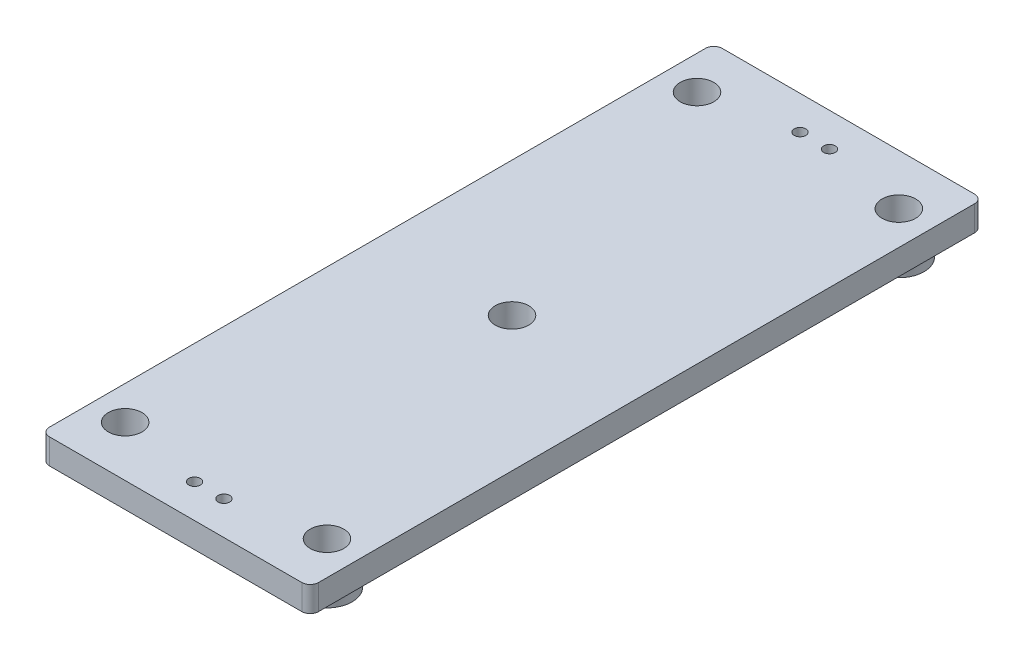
ISO-10303-21;
HEADER;
FILE_DESCRIPTION(('STEP AP214'),'2;1');
FILE_NAME('part.step','',(''),(''),'','','');
FILE_SCHEMA(('AUTOMOTIVE_DESIGN { 1 0 10303 214 1 1 1 1 }'));
ENDSEC;
DATA;
#1=APPLICATION_CONTEXT('core data for automotive mechanical design processes');
#2=APPLICATION_PROTOCOL_DEFINITION('international standard','automotive_design',2000,#1);
#3=PRODUCT_CONTEXT('',#1,'mechanical');
#4=PRODUCT('Part','Part','',(#3));
#5=PRODUCT_RELATED_PRODUCT_CATEGORY('part','',(#4));
#6=PRODUCT_DEFINITION_FORMATION('','',#4);
#7=PRODUCT_DEFINITION_CONTEXT('part definition',#1,'design');
#8=PRODUCT_DEFINITION('design','',#6,#7);
#9=PRODUCT_DEFINITION_SHAPE('','',#8);
#10=(LENGTH_UNIT() NAMED_UNIT(*) SI_UNIT(.MILLI.,.METRE.));
#11=(NAMED_UNIT(*) PLANE_ANGLE_UNIT() SI_UNIT($,.RADIAN.));
#12=(NAMED_UNIT(*) SI_UNIT($,.STERADIAN.) SOLID_ANGLE_UNIT());
#13=UNCERTAINTY_MEASURE_WITH_UNIT(LENGTH_MEASURE(1.E-05),#10,'distance_accuracy_value','');
#14=(GEOMETRIC_REPRESENTATION_CONTEXT(3) GLOBAL_UNCERTAINTY_ASSIGNED_CONTEXT((#13)) GLOBAL_UNIT_ASSIGNED_CONTEXT((#10,
#11,#12)) REPRESENTATION_CONTEXT('',''));
#15=CARTESIAN_POINT('',(0.,0.,0.));
#16=DIRECTION('',(0.,0.,1.));
#17=DIRECTION('',(1.,0.,0.));
#18=AXIS2_PLACEMENT_3D('',#15,#16,#17);
#19=CARTESIAN_POINT('',(101.6,0.,0.));
#20=DIRECTION('',(0.,-1.,0.));
#21=DIRECTION('',(0.,0.,-1.));
#22=AXIS2_PLACEMENT_3D('',#19,#20,#21);
#23=PLANE('',#22);
#24=CARTESIAN_POINT('',(76.1999999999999,0.,469.9));
#25=DIRECTION('',(0.,-1.,0.));
#26=DIRECTION('',(0.,0.,-1.));
#27=AXIS2_PLACEMENT_3D('',#24,#25,#26);
#28=CIRCLE('',#27,22.225);
#29=CARTESIAN_POINT('',(76.1999999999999,0.,447.675));
#30=VERTEX_POINT('',#29);
#31=EDGE_CURVE('E173',#30,#30,#28,.F.);
#32=ORIENTED_EDGE('',*,*,#31,.T.);
#33=EDGE_LOOP('',(#32));
#34=FACE_BOUND('',#33,.T.);
#35=CARTESIAN_POINT('',(-76.2000000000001,0.,469.9));
#36=DIRECTION('',(0.,-1.,0.));
#37=DIRECTION('',(0.,0.,-1.));
#38=AXIS2_PLACEMENT_3D('',#35,#36,#37);
#39=CIRCLE('',#38,22.225);
#40=CARTESIAN_POINT('',(-76.2000000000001,0.,447.675));
#41=VERTEX_POINT('',#40);
#42=EDGE_CURVE('E170',#41,#41,#39,.F.);
#43=ORIENTED_EDGE('',*,*,#42,.T.);
#44=EDGE_LOOP('',(#43));
#45=FACE_BOUND('',#44,.T.);
#46=CARTESIAN_POINT('',(-76.2000000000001,0.,38.1));
#47=DIRECTION('',(0.,-1.,0.));
#48=DIRECTION('',(0.,0.,-1.));
#49=AXIS2_PLACEMENT_3D('',#46,#47,#48);
#50=CIRCLE('',#49,22.225);
#51=CARTESIAN_POINT('',(-76.2000000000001,0.,15.875));
#52=VERTEX_POINT('',#51);
#53=EDGE_CURVE('E167',#52,#52,#50,.F.);
#54=ORIENTED_EDGE('',*,*,#53,.T.);
#55=EDGE_LOOP('',(#54));
#56=FACE_BOUND('',#55,.T.);
#57=CARTESIAN_POINT('',(76.1999999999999,0.,38.1));
#58=DIRECTION('',(0.,-1.,0.));
#59=DIRECTION('',(0.,0.,-1.));
#60=AXIS2_PLACEMENT_3D('',#57,#58,#59);
#61=CIRCLE('',#60,22.225);
#62=CARTESIAN_POINT('',(76.1999999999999,0.,15.875));
#63=VERTEX_POINT('',#62);
#64=EDGE_CURVE('E164',#63,#63,#61,.F.);
#65=ORIENTED_EDGE('',*,*,#64,.T.);
#66=EDGE_LOOP('',(#65));
#67=FACE_BOUND('',#66,.T.);
#68=CARTESIAN_POINT('',(-11.1125000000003,0.,25.3999999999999));
#69=DIRECTION('',(0.,1.,0.));
#70=DIRECTION('',(0.,0.,1.));
#71=AXIS2_PLACEMENT_3D('',#68,#69,#70);
#72=CIRCLE('',#71,4.365625);
#73=CARTESIAN_POINT('',(-11.1125000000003,0.,21.0343749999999));
#74=VERTEX_POINT('',#73);
#75=EDGE_CURVE('E278',#74,#74,#72,.T.);
#76=ORIENTED_EDGE('',*,*,#75,.T.);
#77=EDGE_LOOP('',(#76));
#78=FACE_BOUND('',#77,.T.);
#79=CARTESIAN_POINT('',(-11.1125000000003,0.,482.6));
#80=DIRECTION('',(0.,-1.,0.));
#81=DIRECTION('',(0.,0.,-1.));
#82=AXIS2_PLACEMENT_3D('',#79,#80,#81);
#83=CIRCLE('',#82,4.365625);
#84=CARTESIAN_POINT('',(-11.1125000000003,0.,478.234375));
#85=VERTEX_POINT('',#84);
#86=EDGE_CURVE('E288',#85,#85,#83,.T.);
#87=ORIENTED_EDGE('',*,*,#86,.F.);
#88=EDGE_LOOP('',(#87));
#89=FACE_BOUND('',#88,.T.);
#90=CARTESIAN_POINT('',(11.1124999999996,0.,482.6));
#91=DIRECTION('',(0.,-1.,0.));
#92=DIRECTION('',(0.,0.,-1.));
#93=AXIS2_PLACEMENT_3D('',#90,#91,#92);
#94=CIRCLE('',#93,4.365625);
#95=CARTESIAN_POINT('',(11.1124999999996,0.,478.234375));
#96=VERTEX_POINT('',#95);
#97=EDGE_CURVE('E293',#96,#96,#94,.T.);
#98=ORIENTED_EDGE('',*,*,#97,.F.);
#99=EDGE_LOOP('',(#98));
#100=FACE_BOUND('',#99,.T.);
#101=CARTESIAN_POINT('',(0.,0.,254.));
#102=DIRECTION('',(0.,-1.,0.));
#103=DIRECTION('',(0.,0.,-1.));
#104=AXIS2_PLACEMENT_3D('',#101,#102,#103);
#105=CIRCLE('',#104,12.7);
#106=CARTESIAN_POINT('',(0.,0.,241.3));
#107=VERTEX_POINT('',#106);
#108=EDGE_CURVE('E304',#107,#107,#105,.T.);
#109=ORIENTED_EDGE('',*,*,#108,.F.);
#110=EDGE_LOOP('',(#109));
#111=FACE_BOUND('',#110,.T.);
#112=DIRECTION('',(1.,0.,0.));
#113=VECTOR('',#112,1.);
#114=CARTESIAN_POINT('',(-101.6,0.,508.));
#115=LINE('',#114,#113);
#116=CARTESIAN_POINT('',(-95.25,0.,508.));
#117=VERTEX_POINT('',#116);
#118=CARTESIAN_POINT('',(95.2499999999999,0.,508.));
#119=VERTEX_POINT('',#118);
#120=EDGE_CURVE('E116',#117,#119,#115,.T.);
#121=ORIENTED_EDGE('',*,*,#120,.F.);
#122=CARTESIAN_POINT('',(-95.25,0.,501.65));
#123=DIRECTION('',(0.,-1.,0.));
#124=DIRECTION('',(0.,0.,-1.));
#125=AXIS2_PLACEMENT_3D('',#122,#123,#124);
#126=CIRCLE('',#125,6.35);
#127=CARTESIAN_POINT('',(-101.6,0.,501.65));
#128=VERTEX_POINT('',#127);
#129=EDGE_CURVE('E99',#117,#128,#126,.T.);
#130=ORIENTED_EDGE('',*,*,#129,.T.);
#131=DIRECTION('',(0.,0.,-1.));
#132=VECTOR('',#131,1.);
#133=CARTESIAN_POINT('',(-101.6,0.,508.));
#134=LINE('',#133,#132);
#135=CARTESIAN_POINT('',(-101.6,0.,6.35000000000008));
#136=VERTEX_POINT('',#135);
#137=EDGE_CURVE('E125',#128,#136,#134,.T.);
#138=ORIENTED_EDGE('',*,*,#137,.T.);
#139=CARTESIAN_POINT('',(-95.25,0.,6.35000000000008));
#140=DIRECTION('',(0.,-1.,0.));
#141=DIRECTION('',(0.,0.,-1.));
#142=AXIS2_PLACEMENT_3D('',#139,#140,#141);
#143=CIRCLE('',#142,6.35);
#144=CARTESIAN_POINT('',(-95.25,0.,0.));
#145=VERTEX_POINT('',#144);
#146=EDGE_CURVE('E110',#136,#145,#143,.T.);
#147=ORIENTED_EDGE('',*,*,#146,.T.);
#148=DIRECTION('',(-1.,0.,0.));
#149=VECTOR('',#148,1.);
#150=CARTESIAN_POINT('',(101.6,0.,0.));
#151=LINE('',#150,#149);
#152=CARTESIAN_POINT('',(95.25,0.,0.));
#153=VERTEX_POINT('',#152);
#154=EDGE_CURVE('E128',#153,#145,#151,.T.);
#155=ORIENTED_EDGE('',*,*,#154,.F.);
#156=CARTESIAN_POINT('',(95.25,0.,6.35000000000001));
#157=DIRECTION('',(0.,-1.,0.));
#158=DIRECTION('',(0.,0.,-1.));
#159=AXIS2_PLACEMENT_3D('',#156,#157,#158);
#160=CIRCLE('',#159,6.35);
#161=CARTESIAN_POINT('',(101.6,0.,6.35000000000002));
#162=VERTEX_POINT('',#161);
#163=EDGE_CURVE('E139',#153,#162,#160,.T.);
#164=ORIENTED_EDGE('',*,*,#163,.T.);
#165=DIRECTION('',(0.,0.,1.));
#166=VECTOR('',#165,1.);
#167=CARTESIAN_POINT('',(101.6,0.,0.));
#168=LINE('',#167,#166);
#169=CARTESIAN_POINT('',(101.6,0.,501.65));
#170=VERTEX_POINT('',#169);
#171=EDGE_CURVE('E126',#162,#170,#168,.T.);
#172=ORIENTED_EDGE('',*,*,#171,.T.);
#173=CARTESIAN_POINT('',(95.2499999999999,0.,501.65));
#174=DIRECTION('',(0.,-1.,0.));
#175=DIRECTION('',(0.,0.,-1.));
#176=AXIS2_PLACEMENT_3D('',#173,#174,#175);
#177=CIRCLE('',#176,6.35);
#178=EDGE_CURVE('E120',#170,#119,#177,.T.);
#179=ORIENTED_EDGE('',*,*,#178,.T.);
#180=EDGE_LOOP('',(#121,#130,#138,#147,#155,#164,#172,#179));
#181=FACE_BOUND('',#180,.T.);
#182=CARTESIAN_POINT('',(11.1124999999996,0.,25.3999999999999));
#183=DIRECTION('',(0.,1.,0.));
#184=DIRECTION('',(0.,0.,1.));
#185=AXIS2_PLACEMENT_3D('',#182,#183,#184);
#186=CIRCLE('',#185,4.365625);
#187=CARTESIAN_POINT('',(11.1124999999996,0.,21.0343749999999));
#188=VERTEX_POINT('',#187);
#189=EDGE_CURVE('E279',#188,#188,#186,.T.);
#190=ORIENTED_EDGE('',*,*,#189,.T.);
#191=EDGE_LOOP('',(#190));
#192=FACE_BOUND('',#191,.T.);
#193=ADVANCED_FACE('F32',(#34,#45,#56,#67,#78,#89,#100,#111,#181,#192),#23,.T.);
#194=CARTESIAN_POINT('',(101.6,19.05,0.));
#195=DIRECTION('',(0.,-1.,0.));
#196=DIRECTION('',(0.,0.,-1.));
#197=AXIS2_PLACEMENT_3D('',#194,#195,#196);
#198=PLANE('',#197);
#199=CARTESIAN_POINT('',(-11.1125000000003,19.05,25.3999999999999));
#200=DIRECTION('',(0.,1.,0.));
#201=DIRECTION('',(0.,0.,1.));
#202=AXIS2_PLACEMENT_3D('',#199,#200,#201);
#203=CIRCLE('',#202,4.365625);
#204=CARTESIAN_POINT('',(-11.1125000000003,19.05,21.0343749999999));
#205=VERTEX_POINT('',#204);
#206=EDGE_CURVE('E282',#205,#205,#203,.T.);
#207=ORIENTED_EDGE('',*,*,#206,.F.);
#208=EDGE_LOOP('',(#207));
#209=FACE_BOUND('',#208,.T.);
#210=CARTESIAN_POINT('',(-11.1125000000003,19.05,482.6));
#211=DIRECTION('',(0.,-1.,0.));
#212=DIRECTION('',(0.,0.,-1.));
#213=AXIS2_PLACEMENT_3D('',#210,#211,#212);
#214=CIRCLE('',#213,4.365625);
#215=CARTESIAN_POINT('',(-11.1125000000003,19.05,478.234375));
#216=VERTEX_POINT('',#215);
#217=EDGE_CURVE('E290',#216,#216,#214,.T.);
#218=ORIENTED_EDGE('',*,*,#217,.T.);
#219=EDGE_LOOP('',(#218));
#220=FACE_BOUND('',#219,.T.);
#221=CARTESIAN_POINT('',(11.1124999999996,19.05,482.6));
#222=DIRECTION('',(0.,-1.,0.));
#223=DIRECTION('',(0.,0.,-1.));
#224=AXIS2_PLACEMENT_3D('',#221,#222,#223);
#225=CIRCLE('',#224,4.365625);
#226=CARTESIAN_POINT('',(11.1124999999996,19.05,478.234375));
#227=VERTEX_POINT('',#226);
#228=EDGE_CURVE('E296',#227,#227,#225,.T.);
#229=ORIENTED_EDGE('',*,*,#228,.T.);
#230=EDGE_LOOP('',(#229));
#231=FACE_BOUND('',#230,.T.);
#232=CARTESIAN_POINT('',(0.,19.05,254.));
#233=DIRECTION('',(0.,1.,0.));
#234=DIRECTION('',(0.,0.,1.));
#235=AXIS2_PLACEMENT_3D('',#232,#233,#234);
#236=CIRCLE('',#235,12.7);
#237=CARTESIAN_POINT('',(0.,19.05,266.7));
#238=VERTEX_POINT('',#237);
#239=EDGE_CURVE('E299',#238,#238,#236,.T.);
#240=ORIENTED_EDGE('',*,*,#239,.F.);
#241=EDGE_LOOP('',(#240));
#242=FACE_BOUND('',#241,.T.);
#243=CARTESIAN_POINT('',(-76.2000000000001,19.05,38.1));
#244=DIRECTION('',(0.,-1.,0.));
#245=DIRECTION('',(0.,0.,-1.));
#246=AXIS2_PLACEMENT_3D('',#243,#244,#245);
#247=CIRCLE('',#246,12.7);
#248=CARTESIAN_POINT('',(-76.2000000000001,19.05,25.4));
#249=VERTEX_POINT('',#248);
#250=EDGE_CURVE('E308',#249,#249,#247,.T.);
#251=ORIENTED_EDGE('',*,*,#250,.T.);
#252=EDGE_LOOP('',(#251));
#253=FACE_BOUND('',#252,.T.);
#254=CARTESIAN_POINT('',(76.1999999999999,19.05,38.1));
#255=DIRECTION('',(0.,-1.,0.));
#256=DIRECTION('',(0.,0.,-1.));
#257=AXIS2_PLACEMENT_3D('',#254,#255,#256);
#258=CIRCLE('',#257,12.7);
#259=CARTESIAN_POINT('',(76.1999999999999,19.05,25.4));
#260=VERTEX_POINT('',#259);
#261=EDGE_CURVE('E314',#260,#260,#258,.T.);
#262=ORIENTED_EDGE('',*,*,#261,.T.);
#263=EDGE_LOOP('',(#262));
#264=FACE_BOUND('',#263,.T.);
#265=CARTESIAN_POINT('',(-76.2000000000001,19.05,469.9));
#266=DIRECTION('',(0.,-1.,0.));
#267=DIRECTION('',(0.,0.,-1.));
#268=AXIS2_PLACEMENT_3D('',#265,#266,#267);
#269=CIRCLE('',#268,12.7);
#270=CARTESIAN_POINT('',(-76.2000000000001,19.05,457.2));
#271=VERTEX_POINT('',#270);
#272=EDGE_CURVE('E320',#271,#271,#269,.T.);
#273=ORIENTED_EDGE('',*,*,#272,.T.);
#274=EDGE_LOOP('',(#273));
#275=FACE_BOUND('',#274,.T.);
#276=CARTESIAN_POINT('',(76.1999999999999,19.05,469.9));
#277=DIRECTION('',(0.,-1.,0.));
#278=DIRECTION('',(0.,0.,-1.));
#279=AXIS2_PLACEMENT_3D('',#276,#277,#278);
#280=CIRCLE('',#279,12.7);
#281=CARTESIAN_POINT('',(76.1999999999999,19.05,457.2));
#282=VERTEX_POINT('',#281);
#283=EDGE_CURVE('E326',#282,#282,#280,.T.);
#284=ORIENTED_EDGE('',*,*,#283,.T.);
#285=EDGE_LOOP('',(#284));
#286=FACE_BOUND('',#285,.T.);
#287=DIRECTION('',(0.,0.,-1.));
#288=VECTOR('',#287,1.);
#289=CARTESIAN_POINT('',(-101.6,19.05,508.));
#290=LINE('',#289,#288);
#291=CARTESIAN_POINT('',(-101.6,19.05,501.65));
#292=VERTEX_POINT('',#291);
#293=CARTESIAN_POINT('',(-101.6,19.05,6.35000000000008));
#294=VERTEX_POINT('',#293);
#295=EDGE_CURVE('E262',#292,#294,#290,.T.);
#296=ORIENTED_EDGE('',*,*,#295,.F.);
#297=CARTESIAN_POINT('',(-95.25,19.05,501.65));
#298=DIRECTION('',(0.,-1.,0.));
#299=DIRECTION('',(0.,0.,-1.));
#300=AXIS2_PLACEMENT_3D('',#297,#298,#299);
#301=CIRCLE('',#300,6.35);
#302=CARTESIAN_POINT('',(-95.25,19.05,508.));
#303=VERTEX_POINT('',#302);
#304=EDGE_CURVE('E150',#292,#303,#301,.F.);
#305=ORIENTED_EDGE('',*,*,#304,.T.);
#306=DIRECTION('',(1.,0.,0.));
#307=VECTOR('',#306,1.);
#308=CARTESIAN_POINT('',(-101.6,19.05,508.));
#309=LINE('',#308,#307);
#310=CARTESIAN_POINT('',(95.2499999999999,19.05,508.));
#311=VERTEX_POINT('',#310);
#312=EDGE_CURVE('E119',#303,#311,#309,.T.);
#313=ORIENTED_EDGE('',*,*,#312,.T.);
#314=CARTESIAN_POINT('',(95.2499999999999,19.05,501.65));
#315=DIRECTION('',(0.,-1.,0.));
#316=DIRECTION('',(0.,0.,-1.));
#317=AXIS2_PLACEMENT_3D('',#314,#315,#316);
#318=CIRCLE('',#317,6.35);
#319=CARTESIAN_POINT('',(101.6,19.05,501.65));
#320=VERTEX_POINT('',#319);
#321=EDGE_CURVE('E145',#311,#320,#318,.F.);
#322=ORIENTED_EDGE('',*,*,#321,.T.);
#323=DIRECTION('',(0.,0.,1.));
#324=VECTOR('',#323,1.);
#325=CARTESIAN_POINT('',(101.6,19.05,0.));
#326=LINE('',#325,#324);
#327=CARTESIAN_POINT('',(101.6,19.05,6.35000000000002));
#328=VERTEX_POINT('',#327);
#329=EDGE_CURVE('E135',#328,#320,#326,.T.);
#330=ORIENTED_EDGE('',*,*,#329,.F.);
#331=CARTESIAN_POINT('',(95.25,19.05,6.35000000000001));
#332=DIRECTION('',(0.,-1.,0.));
#333=DIRECTION('',(0.,0.,-1.));
#334=AXIS2_PLACEMENT_3D('',#331,#332,#333);
#335=CIRCLE('',#334,6.35);
#336=CARTESIAN_POINT('',(95.25,19.05,0.));
#337=VERTEX_POINT('',#336);
#338=EDGE_CURVE('E54',#328,#337,#335,.F.);
#339=ORIENTED_EDGE('',*,*,#338,.T.);
#340=DIRECTION('',(-1.,0.,0.));
#341=VECTOR('',#340,1.);
#342=CARTESIAN_POINT('',(101.6,19.05,0.));
#343=LINE('',#342,#341);
#344=CARTESIAN_POINT('',(-95.25,19.05,0.));
#345=VERTEX_POINT('',#344);
#346=EDGE_CURVE('E136',#337,#345,#343,.T.);
#347=ORIENTED_EDGE('',*,*,#346,.T.);
#348=CARTESIAN_POINT('',(-95.25,19.05,6.35000000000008));
#349=DIRECTION('',(0.,-1.,0.));
#350=DIRECTION('',(0.,0.,-1.));
#351=AXIS2_PLACEMENT_3D('',#348,#349,#350);
#352=CIRCLE('',#351,6.35);
#353=EDGE_CURVE('E148',#345,#294,#352,.F.);
#354=ORIENTED_EDGE('',*,*,#353,.T.);
#355=EDGE_LOOP('',(#296,#305,#313,#322,#330,#339,#347,#354));
#356=FACE_BOUND('',#355,.T.);
#357=CARTESIAN_POINT('',(11.1124999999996,19.05,25.3999999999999));
#358=DIRECTION('',(0.,1.,0.));
#359=DIRECTION('',(0.,0.,1.));
#360=AXIS2_PLACEMENT_3D('',#357,#358,#359);
#361=CIRCLE('',#360,4.365625);
#362=CARTESIAN_POINT('',(11.1124999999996,19.05,21.0343749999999));
#363=VERTEX_POINT('',#362);
#364=EDGE_CURVE('E276',#363,#363,#361,.T.);
#365=ORIENTED_EDGE('',*,*,#364,.F.);
#366=EDGE_LOOP('',(#365));
#367=FACE_BOUND('',#366,.T.);
#368=ADVANCED_FACE('F198',(#209,#220,#231,#242,#253,#264,#275,#286,#356,#367),#198,.F.);
#369=CARTESIAN_POINT('',(101.6,19.05,0.));
#370=DIRECTION('',(1.,0.,0.));
#371=DIRECTION('',(0.,0.,-1.));
#372=AXIS2_PLACEMENT_3D('',#369,#370,#371);
#373=PLANE('',#372);
#374=ORIENTED_EDGE('',*,*,#171,.F.);
#375=DIRECTION('',(0.,-1.,0.));
#376=VECTOR('',#375,1.);
#377=CARTESIAN_POINT('',(101.6,19.05,6.35000000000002));
#378=LINE('',#377,#376);
#379=EDGE_CURVE('E159',#162,#328,#378,.F.);
#380=ORIENTED_EDGE('',*,*,#379,.T.);
#381=ORIENTED_EDGE('',*,*,#329,.T.);
#382=DIRECTION('',(0.,-1.,0.));
#383=VECTOR('',#382,1.);
#384=CARTESIAN_POINT('',(101.6,0.,501.65));
#385=LINE('',#384,#383);
#386=EDGE_CURVE('E156',#320,#170,#385,.T.);
#387=ORIENTED_EDGE('',*,*,#386,.T.);
#388=EDGE_LOOP('',(#374,#380,#381,#387));
#389=FACE_BOUND('',#388,.T.);
#390=ADVANCED_FACE('F204',(#389),#373,.T.);
#391=CARTESIAN_POINT('',(101.6,19.05,0.));
#392=DIRECTION('',(0.,0.,1.));
#393=DIRECTION('',(1.,0.,0.));
#394=AXIS2_PLACEMENT_3D('',#391,#392,#393);
#395=PLANE('',#394);
#396=ORIENTED_EDGE('',*,*,#154,.T.);
#397=DIRECTION('',(0.,-1.,0.));
#398=VECTOR('',#397,1.);
#399=CARTESIAN_POINT('',(-95.25,19.05,0.));
#400=LINE('',#399,#398);
#401=EDGE_CURVE('E47',#145,#345,#400,.F.);
#402=ORIENTED_EDGE('',*,*,#401,.T.);
#403=ORIENTED_EDGE('',*,*,#346,.F.);
#404=DIRECTION('',(0.,-1.,0.));
#405=VECTOR('',#404,1.);
#406=CARTESIAN_POINT('',(95.25,0.,0.));
#407=LINE('',#406,#405);
#408=EDGE_CURVE('E152',#337,#153,#407,.T.);
#409=ORIENTED_EDGE('',*,*,#408,.T.);
#410=EDGE_LOOP('',(#396,#402,#403,#409));
#411=FACE_BOUND('',#410,.T.);
#412=ADVANCED_FACE('F210',(#411),#395,.F.);
#413=CARTESIAN_POINT('',(-101.6,19.05,508.));
#414=DIRECTION('',(-1.,0.,0.));
#415=DIRECTION('',(0.,0.,1.));
#416=AXIS2_PLACEMENT_3D('',#413,#414,#415);
#417=PLANE('',#416);
#418=ORIENTED_EDGE('',*,*,#137,.F.);
#419=DIRECTION('',(0.,-1.,0.));
#420=VECTOR('',#419,1.);
#421=CARTESIAN_POINT('',(-101.6,19.05,501.65));
#422=LINE('',#421,#420);
#423=EDGE_CURVE('E104',#128,#292,#422,.F.);
#424=ORIENTED_EDGE('',*,*,#423,.T.);
#425=ORIENTED_EDGE('',*,*,#295,.T.);
#426=DIRECTION('',(0.,-1.,0.));
#427=VECTOR('',#426,1.);
#428=CARTESIAN_POINT('',(-101.6,0.,6.35000000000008));
#429=LINE('',#428,#427);
#430=EDGE_CURVE('E109',#294,#136,#429,.T.);
#431=ORIENTED_EDGE('',*,*,#430,.T.);
#432=EDGE_LOOP('',(#418,#424,#425,#431));
#433=FACE_BOUND('',#432,.T.);
#434=ADVANCED_FACE('F213',(#433),#417,.T.);
#435=CARTESIAN_POINT('',(-101.6,19.05,508.));
#436=DIRECTION('',(0.,0.,-1.));
#437=DIRECTION('',(-1.,0.,0.));
#438=AXIS2_PLACEMENT_3D('',#435,#436,#437);
#439=PLANE('',#438);
#440=ORIENTED_EDGE('',*,*,#312,.F.);
#441=DIRECTION('',(0.,-1.,0.));
#442=VECTOR('',#441,1.);
#443=CARTESIAN_POINT('',(-95.25,0.,508.));
#444=LINE('',#443,#442);
#445=EDGE_CURVE('E103',#303,#117,#444,.T.);
#446=ORIENTED_EDGE('',*,*,#445,.T.);
#447=ORIENTED_EDGE('',*,*,#120,.T.);
#448=DIRECTION('',(0.,-1.,0.));
#449=VECTOR('',#448,1.);
#450=CARTESIAN_POINT('',(95.2499999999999,19.05,508.));
#451=LINE('',#450,#449);
#452=EDGE_CURVE('E121',#119,#311,#451,.F.);
#453=ORIENTED_EDGE('',*,*,#452,.T.);
#454=EDGE_LOOP('',(#440,#446,#447,#453));
#455=FACE_BOUND('',#454,.T.);
#456=ADVANCED_FACE('F115',(#455),#439,.F.);
#457=CARTESIAN_POINT('',(76.1999999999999,-12.7,469.9));
#458=DIRECTION('',(0.,1.,0.));
#459=DIRECTION('',(0.,0.,1.));
#460=AXIS2_PLACEMENT_3D('',#457,#458,#459);
#461=CYLINDRICAL_SURFACE('',#460,19.05);
#462=CARTESIAN_POINT('',(76.1999999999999,-3.175,469.9));
#463=DIRECTION('',(0.,-1.,0.));
#464=DIRECTION('',(0.,0.,-1.));
#465=AXIS2_PLACEMENT_3D('',#462,#463,#464);
#466=CIRCLE('',#465,19.05);
#467=CARTESIAN_POINT('',(76.1999999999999,-3.175,450.85));
#468=VERTEX_POINT('',#467);
#469=EDGE_CURVE('E161',#468,#468,#466,.T.);
#470=ORIENTED_EDGE('',*,*,#469,.T.);
#471=EDGE_LOOP('',(#470));
#472=FACE_BOUND('',#471,.T.);
#473=CARTESIAN_POINT('',(76.1999999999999,-12.7,469.9));
#474=DIRECTION('',(0.,-1.,0.));
#475=DIRECTION('',(0.,0.,-1.));
#476=AXIS2_PLACEMENT_3D('',#473,#474,#475);
#477=CIRCLE('',#476,19.05);
#478=CARTESIAN_POINT('',(76.1999999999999,-12.7,450.85));
#479=VERTEX_POINT('',#478);
#480=EDGE_CURVE('E130',#479,#479,#477,.T.);
#481=ORIENTED_EDGE('',*,*,#480,.F.);
#482=EDGE_LOOP('',(#481));
#483=FACE_BOUND('',#482,.T.);
#484=ADVANCED_FACE('F219',(#472,#483),#461,.T.);
#485=CARTESIAN_POINT('',(76.1999999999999,-12.7,469.9));
#486=DIRECTION('',(0.,-1.,0.));
#487=DIRECTION('',(0.,0.,-1.));
#488=AXIS2_PLACEMENT_3D('',#485,#486,#487);
#489=PLANE('',#488);
#490=CARTESIAN_POINT('',(76.1999999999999,-12.7,469.9));
#491=DIRECTION('',(0.,-1.,0.));
#492=DIRECTION('',(0.,0.,-1.));
#493=AXIS2_PLACEMENT_3D('',#490,#491,#492);
#494=CIRCLE('',#493,12.7);
#495=CARTESIAN_POINT('',(76.1999999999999,-12.7,457.2));
#496=VERTEX_POINT('',#495);
#497=EDGE_CURVE('E323',#496,#496,#494,.T.);
#498=ORIENTED_EDGE('',*,*,#497,.F.);
#499=EDGE_LOOP('',(#498));
#500=FACE_BOUND('',#499,.T.);
#501=ORIENTED_EDGE('',*,*,#480,.T.);
#502=EDGE_LOOP('',(#501));
#503=FACE_BOUND('',#502,.T.);
#504=ADVANCED_FACE('F248',(#500,#503),#489,.T.);
#505=CARTESIAN_POINT('',(76.1999999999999,-12.7,38.1));
#506=DIRECTION('',(0.,1.,0.));
#507=DIRECTION('',(0.,0.,1.));
#508=AXIS2_PLACEMENT_3D('',#505,#506,#507);
#509=CYLINDRICAL_SURFACE('',#508,19.05);
#510=CARTESIAN_POINT('',(76.1999999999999,-3.175,38.1));
#511=DIRECTION('',(0.,-1.,0.));
#512=DIRECTION('',(0.,0.,-1.));
#513=AXIS2_PLACEMENT_3D('',#510,#511,#512);
#514=CIRCLE('',#513,19.05);
#515=CARTESIAN_POINT('',(76.1999999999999,-3.175,19.05));
#516=VERTEX_POINT('',#515);
#517=EDGE_CURVE('E11',#516,#516,#514,.T.);
#518=ORIENTED_EDGE('',*,*,#517,.T.);
#519=EDGE_LOOP('',(#518));
#520=FACE_BOUND('',#519,.T.);
#521=CARTESIAN_POINT('',(76.1999999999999,-12.7,38.1));
#522=DIRECTION('',(0.,1.,0.));
#523=DIRECTION('',(0.,0.,1.));
#524=AXIS2_PLACEMENT_3D('',#521,#522,#523);
#525=CIRCLE('',#524,19.05);
#526=CARTESIAN_POINT('',(76.1999999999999,-12.7,57.15));
#527=VERTEX_POINT('',#526);
#528=EDGE_CURVE('E252',#527,#527,#525,.T.);
#529=ORIENTED_EDGE('',*,*,#528,.T.);
#530=EDGE_LOOP('',(#529));
#531=FACE_BOUND('',#530,.T.);
#532=ADVANCED_FACE('F347',(#520,#531),#509,.T.);
#533=CARTESIAN_POINT('',(76.1999999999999,-12.7,38.1));
#534=DIRECTION('',(0.,1.,0.));
#535=DIRECTION('',(0.,0.,1.));
#536=AXIS2_PLACEMENT_3D('',#533,#534,#535);
#537=PLANE('',#536);
#538=CARTESIAN_POINT('',(76.1999999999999,-12.7,38.1));
#539=DIRECTION('',(0.,-1.,0.));
#540=DIRECTION('',(0.,0.,-1.));
#541=AXIS2_PLACEMENT_3D('',#538,#539,#540);
#542=CIRCLE('',#541,12.7);
#543=CARTESIAN_POINT('',(76.1999999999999,-12.7,25.4));
#544=VERTEX_POINT('',#543);
#545=EDGE_CURVE('E311',#544,#544,#542,.T.);
#546=ORIENTED_EDGE('',*,*,#545,.F.);
#547=EDGE_LOOP('',(#546));
#548=FACE_BOUND('',#547,.T.);
#549=ORIENTED_EDGE('',*,*,#528,.F.);
#550=EDGE_LOOP('',(#549));
#551=FACE_BOUND('',#550,.T.);
#552=ADVANCED_FACE('F338',(#548,#551),#537,.F.);
#553=CARTESIAN_POINT('',(-76.2000000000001,-12.7,38.1));
#554=DIRECTION('',(0.,1.,0.));
#555=DIRECTION('',(0.,0.,1.));
#556=AXIS2_PLACEMENT_3D('',#553,#554,#555);
#557=CYLINDRICAL_SURFACE('',#556,19.05);
#558=CARTESIAN_POINT('',(-76.2000000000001,-3.175,38.1));
#559=DIRECTION('',(0.,-1.,0.));
#560=DIRECTION('',(0.,0.,-1.));
#561=AXIS2_PLACEMENT_3D('',#558,#559,#560);
#562=CIRCLE('',#561,19.05);
#563=CARTESIAN_POINT('',(-76.2000000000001,-3.175,19.05));
#564=VERTEX_POINT('',#563);
#565=EDGE_CURVE('E40',#564,#564,#562,.T.);
#566=ORIENTED_EDGE('',*,*,#565,.T.);
#567=EDGE_LOOP('',(#566));
#568=FACE_BOUND('',#567,.T.);
#569=CARTESIAN_POINT('',(-76.2000000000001,-12.7,38.1));
#570=DIRECTION('',(0.,-1.,0.));
#571=DIRECTION('',(0.,0.,-1.));
#572=AXIS2_PLACEMENT_3D('',#569,#570,#571);
#573=CIRCLE('',#572,19.05);
#574=CARTESIAN_POINT('',(-76.2000000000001,-12.7,19.05));
#575=VERTEX_POINT('',#574);
#576=EDGE_CURVE('E255',#575,#575,#573,.T.);
#577=ORIENTED_EDGE('',*,*,#576,.F.);
#578=EDGE_LOOP('',(#577));
#579=FACE_BOUND('',#578,.T.);
#580=ADVANCED_FACE('F181',(#568,#579),#557,.T.);
#581=CARTESIAN_POINT('',(-76.2000000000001,-12.7,38.1));
#582=DIRECTION('',(0.,-1.,0.));
#583=DIRECTION('',(0.,0.,-1.));
#584=AXIS2_PLACEMENT_3D('',#581,#582,#583);
#585=PLANE('',#584);
#586=CARTESIAN_POINT('',(-76.2000000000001,-12.7,38.1));
#587=DIRECTION('',(0.,-1.,0.));
#588=DIRECTION('',(0.,0.,-1.));
#589=AXIS2_PLACEMENT_3D('',#586,#587,#588);
#590=CIRCLE('',#589,12.7);
#591=CARTESIAN_POINT('',(-76.2000000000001,-12.7,25.4));
#592=VERTEX_POINT('',#591);
#593=EDGE_CURVE('E307',#592,#592,#590,.T.);
#594=ORIENTED_EDGE('',*,*,#593,.F.);
#595=EDGE_LOOP('',(#594));
#596=FACE_BOUND('',#595,.T.);
#597=ORIENTED_EDGE('',*,*,#576,.T.);
#598=EDGE_LOOP('',(#597));
#599=FACE_BOUND('',#598,.T.);
#600=ADVANCED_FACE('F336',(#596,#599),#585,.T.);
#601=CARTESIAN_POINT('',(-76.2000000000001,-12.7,469.9));
#602=DIRECTION('',(0.,1.,0.));
#603=DIRECTION('',(0.,0.,1.));
#604=AXIS2_PLACEMENT_3D('',#601,#602,#603);
#605=CYLINDRICAL_SURFACE('',#604,19.05);
#606=CARTESIAN_POINT('',(-76.2000000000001,-3.175,469.9));
#607=DIRECTION('',(0.,-1.,0.));
#608=DIRECTION('',(0.,0.,-1.));
#609=AXIS2_PLACEMENT_3D('',#606,#607,#608);
#610=CIRCLE('',#609,19.05);
#611=CARTESIAN_POINT('',(-76.2000000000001,-3.175,450.85));
#612=VERTEX_POINT('',#611);
#613=EDGE_CURVE('E176',#612,#612,#610,.T.);
#614=ORIENTED_EDGE('',*,*,#613,.T.);
#615=EDGE_LOOP('',(#614));
#616=FACE_BOUND('',#615,.T.);
#617=CARTESIAN_POINT('',(-76.2000000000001,-12.7,469.9));
#618=DIRECTION('',(0.,1.,0.));
#619=DIRECTION('',(0.,0.,1.));
#620=AXIS2_PLACEMENT_3D('',#617,#618,#619);
#621=CIRCLE('',#620,19.05);
#622=CARTESIAN_POINT('',(-76.2000000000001,-12.7,488.95));
#623=VERTEX_POINT('',#622);
#624=EDGE_CURVE('E329',#623,#623,#621,.T.);
#625=ORIENTED_EDGE('',*,*,#624,.T.);
#626=EDGE_LOOP('',(#625));
#627=FACE_BOUND('',#626,.T.);
#628=ADVANCED_FACE('F344',(#616,#627),#605,.T.);
#629=CARTESIAN_POINT('',(-76.2000000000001,-12.7,469.9));
#630=DIRECTION('',(0.,1.,0.));
#631=DIRECTION('',(0.,0.,1.));
#632=AXIS2_PLACEMENT_3D('',#629,#630,#631);
#633=PLANE('',#632);
#634=CARTESIAN_POINT('',(-76.2000000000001,-12.7,469.9));
#635=DIRECTION('',(0.,-1.,0.));
#636=DIRECTION('',(0.,0.,-1.));
#637=AXIS2_PLACEMENT_3D('',#634,#635,#636);
#638=CIRCLE('',#637,12.7);
#639=CARTESIAN_POINT('',(-76.2000000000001,-12.7,457.2));
#640=VERTEX_POINT('',#639);
#641=EDGE_CURVE('E317',#640,#640,#638,.T.);
#642=ORIENTED_EDGE('',*,*,#641,.F.);
#643=EDGE_LOOP('',(#642));
#644=FACE_BOUND('',#643,.T.);
#645=ORIENTED_EDGE('',*,*,#624,.F.);
#646=EDGE_LOOP('',(#645));
#647=FACE_BOUND('',#646,.T.);
#648=ADVANCED_FACE('F364',(#644,#647),#633,.F.);
#649=CARTESIAN_POINT('',(76.1999999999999,19.05,469.9));
#650=DIRECTION('',(0.,-1.,0.));
#651=DIRECTION('',(0.,0.,-1.));
#652=AXIS2_PLACEMENT_3D('',#649,#650,#651);
#653=CYLINDRICAL_SURFACE('',#652,12.7);
#654=ORIENTED_EDGE('',*,*,#283,.F.);
#655=EDGE_LOOP('',(#654));
#656=FACE_BOUND('',#655,.T.);
#657=ORIENTED_EDGE('',*,*,#497,.T.);
#658=EDGE_LOOP('',(#657));
#659=FACE_BOUND('',#658,.T.);
#660=ADVANCED_FACE('F361',(#656,#659),#653,.F.);
#661=CARTESIAN_POINT('',(-76.2000000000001,19.05,469.9));
#662=DIRECTION('',(0.,-1.,0.));
#663=DIRECTION('',(0.,0.,-1.));
#664=AXIS2_PLACEMENT_3D('',#661,#662,#663);
#665=CYLINDRICAL_SURFACE('',#664,12.7);
#666=ORIENTED_EDGE('',*,*,#272,.F.);
#667=EDGE_LOOP('',(#666));
#668=FACE_BOUND('',#667,.T.);
#669=ORIENTED_EDGE('',*,*,#641,.T.);
#670=EDGE_LOOP('',(#669));
#671=FACE_BOUND('',#670,.T.);
#672=ADVANCED_FACE('F363',(#668,#671),#665,.F.);
#673=CARTESIAN_POINT('',(76.1999999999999,19.05,38.1));
#674=DIRECTION('',(0.,-1.,0.));
#675=DIRECTION('',(0.,0.,-1.));
#676=AXIS2_PLACEMENT_3D('',#673,#674,#675);
#677=CYLINDRICAL_SURFACE('',#676,12.7);
#678=ORIENTED_EDGE('',*,*,#261,.F.);
#679=EDGE_LOOP('',(#678));
#680=FACE_BOUND('',#679,.T.);
#681=ORIENTED_EDGE('',*,*,#545,.T.);
#682=EDGE_LOOP('',(#681));
#683=FACE_BOUND('',#682,.T.);
#684=ADVANCED_FACE('F371',(#680,#683),#677,.F.);
#685=CARTESIAN_POINT('',(-76.2000000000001,19.05,38.1));
#686=DIRECTION('',(0.,-1.,0.));
#687=DIRECTION('',(0.,0.,-1.));
#688=AXIS2_PLACEMENT_3D('',#685,#686,#687);
#689=CYLINDRICAL_SURFACE('',#688,12.7);
#690=ORIENTED_EDGE('',*,*,#250,.F.);
#691=EDGE_LOOP('',(#690));
#692=FACE_BOUND('',#691,.T.);
#693=ORIENTED_EDGE('',*,*,#593,.T.);
#694=EDGE_LOOP('',(#693));
#695=FACE_BOUND('',#694,.T.);
#696=ADVANCED_FACE('F415',(#692,#695),#689,.F.);
#697=CARTESIAN_POINT('',(0.,-12.7,254.));
#698=DIRECTION('',(0.,1.,0.));
#699=DIRECTION('',(0.,0.,1.));
#700=AXIS2_PLACEMENT_3D('',#697,#698,#699);
#701=CYLINDRICAL_SURFACE('',#700,12.7);
#702=ORIENTED_EDGE('',*,*,#108,.T.);
#703=EDGE_LOOP('',(#702));
#704=FACE_BOUND('',#703,.T.);
#705=ORIENTED_EDGE('',*,*,#239,.T.);
#706=EDGE_LOOP('',(#705));
#707=FACE_BOUND('',#706,.T.);
#708=ADVANCED_FACE('F424',(#704,#707),#701,.F.);
#709=CARTESIAN_POINT('',(11.1124999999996,19.05,482.6));
#710=DIRECTION('',(0.,-1.,0.));
#711=DIRECTION('',(0.,0.,-1.));
#712=AXIS2_PLACEMENT_3D('',#709,#710,#711);
#713=CYLINDRICAL_SURFACE('',#712,4.365625);
#714=CARTESIAN_POINT('',(11.1124999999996,19.05,478.234375));
#715=CARTESIAN_POINT('',(11.1124999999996,18.8515625,478.234375));
#716=CARTESIAN_POINT('',(11.1124999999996,18.653125,478.234375));
#717=CARTESIAN_POINT('',(11.1124999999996,18.25625,478.234375));
#718=CARTESIAN_POINT('',(11.1124999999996,18.0578125,478.234375));
#719=CARTESIAN_POINT('',(11.1124999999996,17.6609375,478.234375));
#720=CARTESIAN_POINT('',(11.1124999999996,17.4625,478.234375));
#721=CARTESIAN_POINT('',(11.1124999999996,17.065625,478.234375));
#722=CARTESIAN_POINT('',(11.1124999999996,16.8671875,478.234375));
#723=CARTESIAN_POINT('',(11.1124999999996,16.4703125,478.234375));
#724=CARTESIAN_POINT('',(11.1124999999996,16.271875,478.234375));
#725=CARTESIAN_POINT('',(11.1124999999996,15.875,478.234375));
#726=CARTESIAN_POINT('',(11.1124999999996,15.6765625,478.234375));
#727=CARTESIAN_POINT('',(11.1124999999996,15.2796875,478.234375));
#728=CARTESIAN_POINT('',(11.1124999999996,15.08125,478.234375));
#729=CARTESIAN_POINT('',(11.1124999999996,14.684375,478.234375));
#730=CARTESIAN_POINT('',(11.1124999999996,14.4859375,478.234375));
#731=CARTESIAN_POINT('',(11.1124999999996,14.0890625,478.234375));
#732=CARTESIAN_POINT('',(11.1124999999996,13.890625,478.234375));
#733=CARTESIAN_POINT('',(11.1124999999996,13.49375,478.234375));
#734=CARTESIAN_POINT('',(11.1124999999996,13.2953125,478.234375));
#735=CARTESIAN_POINT('',(11.1124999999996,12.8984375,478.234375));
#736=CARTESIAN_POINT('',(11.1124999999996,12.7,478.234375));
#737=CARTESIAN_POINT('',(11.1124999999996,12.303125,478.234375));
#738=CARTESIAN_POINT('',(11.1124999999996,12.1046875,478.234375));
#739=CARTESIAN_POINT('',(11.1124999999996,11.7078125,478.234375));
#740=CARTESIAN_POINT('',(11.1124999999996,11.509375,478.234375));
#741=CARTESIAN_POINT('',(11.1124999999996,11.1125,478.234375));
#742=CARTESIAN_POINT('',(11.1124999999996,10.9140625,478.234375));
#743=CARTESIAN_POINT('',(11.1124999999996,10.5171875,478.234375));
#744=CARTESIAN_POINT('',(11.1124999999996,10.31875,478.234375));
#745=CARTESIAN_POINT('',(11.1124999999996,9.921875,478.234375));
#746=CARTESIAN_POINT('',(11.1124999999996,9.7234375,478.234375));
#747=CARTESIAN_POINT('',(11.1124999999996,9.3265625,478.234375));
#748=CARTESIAN_POINT('',(11.1124999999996,9.128125,478.234375));
#749=CARTESIAN_POINT('',(11.1124999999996,8.73125,478.234375));
#750=CARTESIAN_POINT('',(11.1124999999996,8.5328125,478.234375));
#751=CARTESIAN_POINT('',(11.1124999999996,8.1359375,478.234375));
#752=CARTESIAN_POINT('',(11.1124999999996,7.9375,478.234375));
#753=CARTESIAN_POINT('',(11.1124999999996,7.540625,478.234375));
#754=CARTESIAN_POINT('',(11.1124999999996,7.3421875,478.234375));
#755=CARTESIAN_POINT('',(11.1124999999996,6.9453125,478.234375));
#756=CARTESIAN_POINT('',(11.1124999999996,6.746875,478.234375));
#757=CARTESIAN_POINT('',(11.1124999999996,6.35,478.234375));
#758=CARTESIAN_POINT('',(11.1124999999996,6.1515625,478.234375));
#759=CARTESIAN_POINT('',(11.1124999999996,5.7546875,478.234375));
#760=CARTESIAN_POINT('',(11.1124999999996,5.55625,478.234375));
#761=CARTESIAN_POINT('',(11.1124999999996,5.159375,478.234375));
#762=CARTESIAN_POINT('',(11.1124999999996,4.9609375,478.234375));
#763=CARTESIAN_POINT('',(11.1124999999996,4.5640625,478.234375));
#764=CARTESIAN_POINT('',(11.1124999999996,4.365625,478.234375));
#765=CARTESIAN_POINT('',(11.1124999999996,3.96875,478.234375));
#766=CARTESIAN_POINT('',(11.1124999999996,3.7703125,478.234375));
#767=CARTESIAN_POINT('',(11.1124999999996,3.3734375,478.234375));
#768=CARTESIAN_POINT('',(11.1124999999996,3.175,478.234375));
#769=CARTESIAN_POINT('',(11.1124999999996,2.778125,478.234375));
#770=CARTESIAN_POINT('',(11.1124999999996,2.5796875,478.234375));
#771=CARTESIAN_POINT('',(11.1124999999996,2.1828125,478.234375));
#772=CARTESIAN_POINT('',(11.1124999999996,1.984375,478.234375));
#773=CARTESIAN_POINT('',(11.1124999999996,1.5875,478.234375));
#774=CARTESIAN_POINT('',(11.1124999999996,1.3890625,478.234375));
#775=CARTESIAN_POINT('',(11.1124999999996,0.992187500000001,478.234375));
#776=CARTESIAN_POINT('',(11.1124999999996,0.793750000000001,478.234375));
#777=CARTESIAN_POINT('',(11.1124999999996,0.396875,478.234375));
#778=CARTESIAN_POINT('',(11.1124999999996,0.1984375,478.234375));
#779=CARTESIAN_POINT('',(11.1124999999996,0.,478.234375));
#780=B_SPLINE_CURVE_WITH_KNOTS('',3,(#714,#715,#716,#717,#718,#719,#720,#721,#722,#723,#724,
#725,#726,#727,#728,#729,#730,#731,#732,#733,#734,#735,#736,#737,#738,#739,#740,#741,#742,#743,
#744,#745,#746,#747,#748,#749,#750,#751,#752,#753,#754,#755,#756,#757,#758,#759,#760,#761,#762,
#763,#764,#765,#766,#767,#768,#769,#770,#771,#772,#773,#774,#775,#776,#777,#778,#779),
.UNSPECIFIED.,.F.,.F.,(4,2,2,2,2,2,2,2,2,2,2,2,2,2,2,2,2,2,2,2,2,2,2,2,2,2,2,2,2,2,2,2,4),(0.,
0.5953125,1.190625,1.7859375,2.38125,2.9765625,3.571875,4.1671875,4.7625,5.3578125,5.953125,
6.5484375,7.14375,7.7390625,8.334375,8.9296875,9.525,10.1203125,10.715625,11.3109375,11.90625,
12.5015625,13.096875,13.6921875,14.2875,14.8828125,15.478125,16.0734375,16.66875,17.2640625,
17.859375,18.4546875,19.05),.UNSPECIFIED.);
#781=EDGE_CURVE('BSEAM434',#227,#96,#780,.T.);
#782=ORIENTED_EDGE('',*,*,#228,.F.);
#783=ORIENTED_EDGE('',*,*,#97,.T.);
#784=ORIENTED_EDGE('',*,*,#781,.T.);
#785=ORIENTED_EDGE('',*,*,#781,.F.);
#786=EDGE_LOOP('',(#782,#784,#783,#785));
#787=FACE_BOUND('',#786,.T.);
#788=ADVANCED_FACE('F434',(#787),#713,.F.);
#789=CARTESIAN_POINT('',(-11.1125000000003,19.05,482.6));
#790=DIRECTION('',(0.,-1.,0.));
#791=DIRECTION('',(0.,0.,-1.));
#792=AXIS2_PLACEMENT_3D('',#789,#790,#791);
#793=CYLINDRICAL_SURFACE('',#792,4.365625);
#794=CARTESIAN_POINT('',(-11.1125000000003,19.05,478.234375));
#795=CARTESIAN_POINT('',(-11.1125000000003,18.8515625,478.234375));
#796=CARTESIAN_POINT('',(-11.1125000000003,18.653125,478.234375));
#797=CARTESIAN_POINT('',(-11.1125000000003,18.25625,478.234375));
#798=CARTESIAN_POINT('',(-11.1125000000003,18.0578125,478.234375));
#799=CARTESIAN_POINT('',(-11.1125000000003,17.6609375,478.234375));
#800=CARTESIAN_POINT('',(-11.1125000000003,17.4625,478.234375));
#801=CARTESIAN_POINT('',(-11.1125000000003,17.065625,478.234375));
#802=CARTESIAN_POINT('',(-11.1125000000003,16.8671875,478.234375));
#803=CARTESIAN_POINT('',(-11.1125000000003,16.4703125,478.234375));
#804=CARTESIAN_POINT('',(-11.1125000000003,16.271875,478.234375));
#805=CARTESIAN_POINT('',(-11.1125000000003,15.875,478.234375));
#806=CARTESIAN_POINT('',(-11.1125000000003,15.6765625,478.234375));
#807=CARTESIAN_POINT('',(-11.1125000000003,15.2796875,478.234375));
#808=CARTESIAN_POINT('',(-11.1125000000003,15.08125,478.234375));
#809=CARTESIAN_POINT('',(-11.1125000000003,14.684375,478.234375));
#810=CARTESIAN_POINT('',(-11.1125000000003,14.4859375,478.234375));
#811=CARTESIAN_POINT('',(-11.1125000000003,14.0890625,478.234375));
#812=CARTESIAN_POINT('',(-11.1125000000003,13.890625,478.234375));
#813=CARTESIAN_POINT('',(-11.1125000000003,13.49375,478.234375));
#814=CARTESIAN_POINT('',(-11.1125000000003,13.2953125,478.234375));
#815=CARTESIAN_POINT('',(-11.1125000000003,12.8984375,478.234375));
#816=CARTESIAN_POINT('',(-11.1125000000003,12.7,478.234375));
#817=CARTESIAN_POINT('',(-11.1125000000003,12.303125,478.234375));
#818=CARTESIAN_POINT('',(-11.1125000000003,12.1046875,478.234375));
#819=CARTESIAN_POINT('',(-11.1125000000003,11.7078125,478.234375));
#820=CARTESIAN_POINT('',(-11.1125000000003,11.509375,478.234375));
#821=CARTESIAN_POINT('',(-11.1125000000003,11.1125,478.234375));
#822=CARTESIAN_POINT('',(-11.1125000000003,10.9140625,478.234375));
#823=CARTESIAN_POINT('',(-11.1125000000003,10.5171875,478.234375));
#824=CARTESIAN_POINT('',(-11.1125000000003,10.31875,478.234375));
#825=CARTESIAN_POINT('',(-11.1125000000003,9.921875,478.234375));
#826=CARTESIAN_POINT('',(-11.1125000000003,9.7234375,478.234375));
#827=CARTESIAN_POINT('',(-11.1125000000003,9.3265625,478.234375));
#828=CARTESIAN_POINT('',(-11.1125000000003,9.128125,478.234375));
#829=CARTESIAN_POINT('',(-11.1125000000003,8.73125,478.234375));
#830=CARTESIAN_POINT('',(-11.1125000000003,8.5328125,478.234375));
#831=CARTESIAN_POINT('',(-11.1125000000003,8.1359375,478.234375));
#832=CARTESIAN_POINT('',(-11.1125000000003,7.9375,478.234375));
#833=CARTESIAN_POINT('',(-11.1125000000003,7.540625,478.234375));
#834=CARTESIAN_POINT('',(-11.1125000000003,7.3421875,478.234375));
#835=CARTESIAN_POINT('',(-11.1125000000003,6.9453125,478.234375));
#836=CARTESIAN_POINT('',(-11.1125000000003,6.746875,478.234375));
#837=CARTESIAN_POINT('',(-11.1125000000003,6.35,478.234375));
#838=CARTESIAN_POINT('',(-11.1125000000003,6.1515625,478.234375));
#839=CARTESIAN_POINT('',(-11.1125000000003,5.7546875,478.234375));
#840=CARTESIAN_POINT('',(-11.1125000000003,5.55625,478.234375));
#841=CARTESIAN_POINT('',(-11.1125000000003,5.159375,478.234375));
#842=CARTESIAN_POINT('',(-11.1125000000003,4.9609375,478.234375));
#843=CARTESIAN_POINT('',(-11.1125000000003,4.5640625,478.234375));
#844=CARTESIAN_POINT('',(-11.1125000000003,4.365625,478.234375));
#845=CARTESIAN_POINT('',(-11.1125000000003,3.96875,478.234375));
#846=CARTESIAN_POINT('',(-11.1125000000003,3.7703125,478.234375));
#847=CARTESIAN_POINT('',(-11.1125000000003,3.3734375,478.234375));
#848=CARTESIAN_POINT('',(-11.1125000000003,3.175,478.234375));
#849=CARTESIAN_POINT('',(-11.1125000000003,2.778125,478.234375));
#850=CARTESIAN_POINT('',(-11.1125000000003,2.5796875,478.234375));
#851=CARTESIAN_POINT('',(-11.1125000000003,2.1828125,478.234375));
#852=CARTESIAN_POINT('',(-11.1125000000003,1.984375,478.234375));
#853=CARTESIAN_POINT('',(-11.1125000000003,1.5875,478.234375));
#854=CARTESIAN_POINT('',(-11.1125000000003,1.3890625,478.234375));
#855=CARTESIAN_POINT('',(-11.1125000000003,0.992187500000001,478.234375));
#856=CARTESIAN_POINT('',(-11.1125000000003,0.793750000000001,478.234375));
#857=CARTESIAN_POINT('',(-11.1125000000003,0.396875,478.234375));
#858=CARTESIAN_POINT('',(-11.1125000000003,0.1984375,478.234375));
#859=CARTESIAN_POINT('',(-11.1125000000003,0.,478.234375));
#860=B_SPLINE_CURVE_WITH_KNOTS('',3,(#794,#795,#796,#797,#798,#799,#800,#801,#802,#803,#804,
#805,#806,#807,#808,#809,#810,#811,#812,#813,#814,#815,#816,#817,#818,#819,#820,#821,#822,#823,
#824,#825,#826,#827,#828,#829,#830,#831,#832,#833,#834,#835,#836,#837,#838,#839,#840,#841,#842,
#843,#844,#845,#846,#847,#848,#849,#850,#851,#852,#853,#854,#855,#856,#857,#858,#859),
.UNSPECIFIED.,.F.,.F.,(4,2,2,2,2,2,2,2,2,2,2,2,2,2,2,2,2,2,2,2,2,2,2,2,2,2,2,2,2,2,2,2,4),(0.,
0.5953125,1.190625,1.7859375,2.38125,2.9765625,3.571875,4.1671875,4.7625,5.3578125,5.953125,
6.5484375,7.14375,7.7390625,8.334375,8.9296875,9.525,10.1203125,10.715625,11.3109375,11.90625,
12.5015625,13.096875,13.6921875,14.2875,14.8828125,15.478125,16.0734375,16.66875,17.2640625,
17.859375,18.4546875,19.05),.UNSPECIFIED.);
#861=EDGE_CURVE('BSEAM445',#216,#85,#860,.T.);
#862=ORIENTED_EDGE('',*,*,#217,.F.);
#863=ORIENTED_EDGE('',*,*,#86,.T.);
#864=ORIENTED_EDGE('',*,*,#861,.T.);
#865=ORIENTED_EDGE('',*,*,#861,.F.);
#866=EDGE_LOOP('',(#862,#864,#863,#865));
#867=FACE_BOUND('',#866,.T.);
#868=ADVANCED_FACE('F445',(#867),#793,.F.);
#869=CARTESIAN_POINT('',(-11.1125000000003,19.05,25.3999999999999));
#870=DIRECTION('',(0.,-1.,0.));
#871=DIRECTION('',(0.,0.,-1.));
#872=AXIS2_PLACEMENT_3D('',#869,#870,#871);
#873=CYLINDRICAL_SURFACE('',#872,4.365625);
#874=CARTESIAN_POINT('',(-11.1125000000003,19.05,21.0343749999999));
#875=CARTESIAN_POINT('',(-11.1125000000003,18.8515625,21.0343749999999));
#876=CARTESIAN_POINT('',(-11.1125000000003,18.653125,21.0343749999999));
#877=CARTESIAN_POINT('',(-11.1125000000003,18.25625,21.0343749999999));
#878=CARTESIAN_POINT('',(-11.1125000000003,18.0578125,21.0343749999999));
#879=CARTESIAN_POINT('',(-11.1125000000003,17.6609375,21.0343749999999));
#880=CARTESIAN_POINT('',(-11.1125000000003,17.4625,21.0343749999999));
#881=CARTESIAN_POINT('',(-11.1125000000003,17.065625,21.0343749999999));
#882=CARTESIAN_POINT('',(-11.1125000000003,16.8671875,21.0343749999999));
#883=CARTESIAN_POINT('',(-11.1125000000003,16.4703125,21.0343749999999));
#884=CARTESIAN_POINT('',(-11.1125000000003,16.271875,21.0343749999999));
#885=CARTESIAN_POINT('',(-11.1125000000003,15.875,21.0343749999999));
#886=CARTESIAN_POINT('',(-11.1125000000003,15.6765625,21.0343749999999));
#887=CARTESIAN_POINT('',(-11.1125000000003,15.2796875,21.0343749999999));
#888=CARTESIAN_POINT('',(-11.1125000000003,15.08125,21.0343749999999));
#889=CARTESIAN_POINT('',(-11.1125000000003,14.684375,21.0343749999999));
#890=CARTESIAN_POINT('',(-11.1125000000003,14.4859375,21.0343749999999));
#891=CARTESIAN_POINT('',(-11.1125000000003,14.0890625,21.0343749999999));
#892=CARTESIAN_POINT('',(-11.1125000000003,13.890625,21.0343749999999));
#893=CARTESIAN_POINT('',(-11.1125000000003,13.49375,21.0343749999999));
#894=CARTESIAN_POINT('',(-11.1125000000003,13.2953125,21.0343749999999));
#895=CARTESIAN_POINT('',(-11.1125000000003,12.8984375,21.0343749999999));
#896=CARTESIAN_POINT('',(-11.1125000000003,12.7,21.0343749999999));
#897=CARTESIAN_POINT('',(-11.1125000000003,12.303125,21.0343749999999));
#898=CARTESIAN_POINT('',(-11.1125000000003,12.1046875,21.0343749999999));
#899=CARTESIAN_POINT('',(-11.1125000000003,11.7078125,21.0343749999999));
#900=CARTESIAN_POINT('',(-11.1125000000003,11.509375,21.0343749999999));
#901=CARTESIAN_POINT('',(-11.1125000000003,11.1125,21.0343749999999));
#902=CARTESIAN_POINT('',(-11.1125000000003,10.9140625,21.0343749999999));
#903=CARTESIAN_POINT('',(-11.1125000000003,10.5171875,21.0343749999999));
#904=CARTESIAN_POINT('',(-11.1125000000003,10.31875,21.0343749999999));
#905=CARTESIAN_POINT('',(-11.1125000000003,9.921875,21.0343749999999));
#906=CARTESIAN_POINT('',(-11.1125000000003,9.7234375,21.0343749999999));
#907=CARTESIAN_POINT('',(-11.1125000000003,9.3265625,21.0343749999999));
#908=CARTESIAN_POINT('',(-11.1125000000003,9.128125,21.0343749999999));
#909=CARTESIAN_POINT('',(-11.1125000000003,8.73125,21.0343749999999));
#910=CARTESIAN_POINT('',(-11.1125000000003,8.5328125,21.0343749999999));
#911=CARTESIAN_POINT('',(-11.1125000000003,8.1359375,21.0343749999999));
#912=CARTESIAN_POINT('',(-11.1125000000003,7.9375,21.0343749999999));
#913=CARTESIAN_POINT('',(-11.1125000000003,7.540625,21.0343749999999));
#914=CARTESIAN_POINT('',(-11.1125000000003,7.3421875,21.0343749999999));
#915=CARTESIAN_POINT('',(-11.1125000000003,6.9453125,21.0343749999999));
#916=CARTESIAN_POINT('',(-11.1125000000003,6.746875,21.0343749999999));
#917=CARTESIAN_POINT('',(-11.1125000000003,6.35,21.0343749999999));
#918=CARTESIAN_POINT('',(-11.1125000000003,6.1515625,21.0343749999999));
#919=CARTESIAN_POINT('',(-11.1125000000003,5.7546875,21.0343749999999));
#920=CARTESIAN_POINT('',(-11.1125000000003,5.55625,21.0343749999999));
#921=CARTESIAN_POINT('',(-11.1125000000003,5.159375,21.0343749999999));
#922=CARTESIAN_POINT('',(-11.1125000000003,4.9609375,21.0343749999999));
#923=CARTESIAN_POINT('',(-11.1125000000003,4.5640625,21.0343749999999));
#924=CARTESIAN_POINT('',(-11.1125000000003,4.365625,21.0343749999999));
#925=CARTESIAN_POINT('',(-11.1125000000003,3.96875,21.0343749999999));
#926=CARTESIAN_POINT('',(-11.1125000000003,3.7703125,21.0343749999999));
#927=CARTESIAN_POINT('',(-11.1125000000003,3.3734375,21.0343749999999));
#928=CARTESIAN_POINT('',(-11.1125000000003,3.175,21.0343749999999));
#929=CARTESIAN_POINT('',(-11.1125000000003,2.778125,21.0343749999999));
#930=CARTESIAN_POINT('',(-11.1125000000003,2.5796875,21.0343749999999));
#931=CARTESIAN_POINT('',(-11.1125000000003,2.1828125,21.0343749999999));
#932=CARTESIAN_POINT('',(-11.1125000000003,1.984375,21.0343749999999));
#933=CARTESIAN_POINT('',(-11.1125000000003,1.5875,21.0343749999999));
#934=CARTESIAN_POINT('',(-11.1125000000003,1.3890625,21.0343749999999));
#935=CARTESIAN_POINT('',(-11.1125000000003,0.992187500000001,21.0343749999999));
#936=CARTESIAN_POINT('',(-11.1125000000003,0.793750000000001,21.0343749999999));
#937=CARTESIAN_POINT('',(-11.1125000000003,0.396875,21.0343749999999));
#938=CARTESIAN_POINT('',(-11.1125000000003,0.1984375,21.0343749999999));
#939=CARTESIAN_POINT('',(-11.1125000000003,0.,21.0343749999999));
#940=B_SPLINE_CURVE_WITH_KNOTS('',3,(#874,#875,#876,#877,#878,#879,#880,#881,#882,#883,#884,
#885,#886,#887,#888,#889,#890,#891,#892,#893,#894,#895,#896,#897,#898,#899,#900,#901,#902,#903,
#904,#905,#906,#907,#908,#909,#910,#911,#912,#913,#914,#915,#916,#917,#918,#919,#920,#921,#922,
#923,#924,#925,#926,#927,#928,#929,#930,#931,#932,#933,#934,#935,#936,#937,#938,#939),
.UNSPECIFIED.,.F.,.F.,(4,2,2,2,2,2,2,2,2,2,2,2,2,2,2,2,2,2,2,2,2,2,2,2,2,2,2,2,2,2,2,2,4),(0.,
0.595312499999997,1.190625,1.7859375,2.38125,2.9765625,3.571875,4.1671875,4.7625,5.3578125,
5.953125,6.5484375,7.14375,7.7390625,8.334375,8.9296875,9.525,10.1203125,10.715625,11.3109375,
11.90625,12.5015625,13.096875,13.6921875,14.2875,14.8828125,15.478125,16.0734375,16.66875,
17.2640625,17.859375,18.4546875,19.05),.UNSPECIFIED.);
#941=EDGE_CURVE('BSEAM456',#205,#74,#940,.T.);
#942=ORIENTED_EDGE('',*,*,#206,.T.);
#943=ORIENTED_EDGE('',*,*,#75,.F.);
#944=ORIENTED_EDGE('',*,*,#941,.T.);
#945=ORIENTED_EDGE('',*,*,#941,.F.);
#946=EDGE_LOOP('',(#942,#944,#943,#945));
#947=FACE_BOUND('',#946,.T.);
#948=ADVANCED_FACE('F456',(#947),#873,.F.);
#949=CARTESIAN_POINT('',(11.1124999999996,19.05,25.3999999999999));
#950=DIRECTION('',(0.,-1.,0.));
#951=DIRECTION('',(0.,0.,-1.));
#952=AXIS2_PLACEMENT_3D('',#949,#950,#951);
#953=CYLINDRICAL_SURFACE('',#952,4.365625);
#954=CARTESIAN_POINT('',(11.1124999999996,19.05,21.0343749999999));
#955=CARTESIAN_POINT('',(11.1124999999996,18.8515625,21.0343749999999));
#956=CARTESIAN_POINT('',(11.1124999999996,18.653125,21.0343749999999));
#957=CARTESIAN_POINT('',(11.1124999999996,18.25625,21.0343749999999));
#958=CARTESIAN_POINT('',(11.1124999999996,18.0578125,21.0343749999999));
#959=CARTESIAN_POINT('',(11.1124999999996,17.6609375,21.0343749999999));
#960=CARTESIAN_POINT('',(11.1124999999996,17.4625,21.0343749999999));
#961=CARTESIAN_POINT('',(11.1124999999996,17.065625,21.0343749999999));
#962=CARTESIAN_POINT('',(11.1124999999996,16.8671875,21.0343749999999));
#963=CARTESIAN_POINT('',(11.1124999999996,16.4703125,21.0343749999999));
#964=CARTESIAN_POINT('',(11.1124999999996,16.271875,21.0343749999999));
#965=CARTESIAN_POINT('',(11.1124999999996,15.875,21.0343749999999));
#966=CARTESIAN_POINT('',(11.1124999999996,15.6765625,21.0343749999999));
#967=CARTESIAN_POINT('',(11.1124999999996,15.2796875,21.0343749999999));
#968=CARTESIAN_POINT('',(11.1124999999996,15.08125,21.0343749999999));
#969=CARTESIAN_POINT('',(11.1124999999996,14.684375,21.0343749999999));
#970=CARTESIAN_POINT('',(11.1124999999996,14.4859375,21.0343749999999));
#971=CARTESIAN_POINT('',(11.1124999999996,14.0890625,21.0343749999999));
#972=CARTESIAN_POINT('',(11.1124999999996,13.890625,21.0343749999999));
#973=CARTESIAN_POINT('',(11.1124999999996,13.49375,21.0343749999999));
#974=CARTESIAN_POINT('',(11.1124999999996,13.2953125,21.0343749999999));
#975=CARTESIAN_POINT('',(11.1124999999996,12.8984375,21.0343749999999));
#976=CARTESIAN_POINT('',(11.1124999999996,12.7,21.0343749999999));
#977=CARTESIAN_POINT('',(11.1124999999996,12.303125,21.0343749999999));
#978=CARTESIAN_POINT('',(11.1124999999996,12.1046875,21.0343749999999));
#979=CARTESIAN_POINT('',(11.1124999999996,11.7078125,21.0343749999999));
#980=CARTESIAN_POINT('',(11.1124999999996,11.509375,21.0343749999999));
#981=CARTESIAN_POINT('',(11.1124999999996,11.1125,21.0343749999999));
#982=CARTESIAN_POINT('',(11.1124999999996,10.9140625,21.0343749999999));
#983=CARTESIAN_POINT('',(11.1124999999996,10.5171875,21.0343749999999));
#984=CARTESIAN_POINT('',(11.1124999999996,10.31875,21.0343749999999));
#985=CARTESIAN_POINT('',(11.1124999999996,9.921875,21.0343749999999));
#986=CARTESIAN_POINT('',(11.1124999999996,9.7234375,21.0343749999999));
#987=CARTESIAN_POINT('',(11.1124999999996,9.3265625,21.0343749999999));
#988=CARTESIAN_POINT('',(11.1124999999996,9.128125,21.0343749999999));
#989=CARTESIAN_POINT('',(11.1124999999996,8.73125,21.0343749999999));
#990=CARTESIAN_POINT('',(11.1124999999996,8.5328125,21.0343749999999));
#991=CARTESIAN_POINT('',(11.1124999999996,8.1359375,21.0343749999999));
#992=CARTESIAN_POINT('',(11.1124999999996,7.9375,21.0343749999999));
#993=CARTESIAN_POINT('',(11.1124999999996,7.540625,21.0343749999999));
#994=CARTESIAN_POINT('',(11.1124999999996,7.3421875,21.0343749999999));
#995=CARTESIAN_POINT('',(11.1124999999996,6.9453125,21.0343749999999));
#996=CARTESIAN_POINT('',(11.1124999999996,6.746875,21.0343749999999));
#997=CARTESIAN_POINT('',(11.1124999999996,6.35,21.0343749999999));
#998=CARTESIAN_POINT('',(11.1124999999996,6.1515625,21.0343749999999));
#999=CARTESIAN_POINT('',(11.1124999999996,5.7546875,21.0343749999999));
#1000=CARTESIAN_POINT('',(11.1124999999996,5.55625,21.0343749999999));
#1001=CARTESIAN_POINT('',(11.1124999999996,5.159375,21.0343749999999));
#1002=CARTESIAN_POINT('',(11.1124999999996,4.9609375,21.0343749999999));
#1003=CARTESIAN_POINT('',(11.1124999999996,4.5640625,21.0343749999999));
#1004=CARTESIAN_POINT('',(11.1124999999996,4.365625,21.0343749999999));
#1005=CARTESIAN_POINT('',(11.1124999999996,3.96875,21.0343749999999));
#1006=CARTESIAN_POINT('',(11.1124999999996,3.7703125,21.0343749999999));
#1007=CARTESIAN_POINT('',(11.1124999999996,3.3734375,21.0343749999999));
#1008=CARTESIAN_POINT('',(11.1124999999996,3.175,21.0343749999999));
#1009=CARTESIAN_POINT('',(11.1124999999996,2.778125,21.0343749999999));
#1010=CARTESIAN_POINT('',(11.1124999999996,2.5796875,21.0343749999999));
#1011=CARTESIAN_POINT('',(11.1124999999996,2.1828125,21.0343749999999));
#1012=CARTESIAN_POINT('',(11.1124999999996,1.984375,21.0343749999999));
#1013=CARTESIAN_POINT('',(11.1124999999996,1.5875,21.0343749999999));
#1014=CARTESIAN_POINT('',(11.1124999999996,1.3890625,21.0343749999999));
#1015=CARTESIAN_POINT('',(11.1124999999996,0.992187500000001,21.0343749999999));
#1016=CARTESIAN_POINT('',(11.1124999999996,0.793750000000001,21.0343749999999));
#1017=CARTESIAN_POINT('',(11.1124999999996,0.396875,21.0343749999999));
#1018=CARTESIAN_POINT('',(11.1124999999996,0.1984375,21.0343749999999));
#1019=CARTESIAN_POINT('',(11.1124999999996,0.,21.0343749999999));
#1020=B_SPLINE_CURVE_WITH_KNOTS('',3,(#954,#955,#956,#957,#958,#959,#960,#961,#962,#963,#964,
#965,#966,#967,#968,#969,#970,#971,#972,#973,#974,#975,#976,#977,#978,#979,#980,#981,#982,#983,
#984,#985,#986,#987,#988,#989,#990,#991,#992,#993,#994,#995,#996,#997,#998,#999,#1000,#1001,
#1002,#1003,#1004,#1005,#1006,#1007,#1008,#1009,#1010,#1011,#1012,#1013,#1014,#1015,#1016,#1017,
#1018,#1019),.UNSPECIFIED.,.F.,.F.,(4,2,2,2,2,2,2,2,2,2,2,2,2,2,2,2,2,2,2,2,2,2,2,2,2,2,2,2,2,2,
2,2,4),(0.,0.595312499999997,1.190625,1.7859375,2.38125,2.9765625,3.571875,4.1671875,4.7625,
5.3578125,5.953125,6.5484375,7.14375,7.7390625,8.334375,8.9296875,9.525,10.1203125,10.715625,
11.3109375,11.90625,12.5015625,13.096875,13.6921875,14.2875,14.8828125,15.478125,16.0734375,
16.66875,17.2640625,17.859375,18.4546875,19.05),.UNSPECIFIED.);
#1021=EDGE_CURVE('BSEAM226',#363,#188,#1020,.T.);
#1022=ORIENTED_EDGE('',*,*,#364,.T.);
#1023=ORIENTED_EDGE('',*,*,#189,.F.);
#1024=ORIENTED_EDGE('',*,*,#1021,.T.);
#1025=ORIENTED_EDGE('',*,*,#1021,.F.);
#1026=EDGE_LOOP('',(#1022,#1024,#1023,#1025));
#1027=FACE_BOUND('',#1026,.T.);
#1028=ADVANCED_FACE('F226',(#1027),#953,.F.);
#1029=CARTESIAN_POINT('',(-95.25,19.05,501.65));
#1030=DIRECTION('',(0.,1.,0.));
#1031=DIRECTION('',(0.,0.,1.));
#1032=AXIS2_PLACEMENT_3D('',#1029,#1030,#1031);
#1033=CYLINDRICAL_SURFACE('',#1032,6.35);
#1034=ORIENTED_EDGE('',*,*,#304,.F.);
#1035=ORIENTED_EDGE('',*,*,#423,.F.);
#1036=ORIENTED_EDGE('',*,*,#129,.F.);
#1037=ORIENTED_EDGE('',*,*,#445,.F.);
#1038=EDGE_LOOP('',(#1034,#1035,#1036,#1037));
#1039=FACE_BOUND('',#1038,.T.);
#1040=ADVANCED_FACE('F102',(#1039),#1033,.T.);
#1041=CARTESIAN_POINT('',(-95.25,19.05,6.35000000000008));
#1042=DIRECTION('',(0.,1.,0.));
#1043=DIRECTION('',(0.,0.,1.));
#1044=AXIS2_PLACEMENT_3D('',#1041,#1042,#1043);
#1045=CYLINDRICAL_SURFACE('',#1044,6.35);
#1046=ORIENTED_EDGE('',*,*,#353,.F.);
#1047=ORIENTED_EDGE('',*,*,#401,.F.);
#1048=ORIENTED_EDGE('',*,*,#146,.F.);
#1049=ORIENTED_EDGE('',*,*,#430,.F.);
#1050=EDGE_LOOP('',(#1046,#1047,#1048,#1049));
#1051=FACE_BOUND('',#1050,.T.);
#1052=ADVANCED_FACE('F225',(#1051),#1045,.T.);
#1053=CARTESIAN_POINT('',(95.25,19.05,6.35000000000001));
#1054=DIRECTION('',(0.,1.,0.));
#1055=DIRECTION('',(0.,0.,1.));
#1056=AXIS2_PLACEMENT_3D('',#1053,#1054,#1055);
#1057=CYLINDRICAL_SURFACE('',#1056,6.35);
#1058=ORIENTED_EDGE('',*,*,#338,.F.);
#1059=ORIENTED_EDGE('',*,*,#379,.F.);
#1060=ORIENTED_EDGE('',*,*,#163,.F.);
#1061=ORIENTED_EDGE('',*,*,#408,.F.);
#1062=EDGE_LOOP('',(#1058,#1059,#1060,#1061));
#1063=FACE_BOUND('',#1062,.T.);
#1064=ADVANCED_FACE('F229',(#1063),#1057,.T.);
#1065=CARTESIAN_POINT('',(95.2499999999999,19.05,501.65));
#1066=DIRECTION('',(0.,1.,0.));
#1067=DIRECTION('',(0.,0.,1.));
#1068=AXIS2_PLACEMENT_3D('',#1065,#1066,#1067);
#1069=CYLINDRICAL_SURFACE('',#1068,6.35);
#1070=ORIENTED_EDGE('',*,*,#321,.F.);
#1071=ORIENTED_EDGE('',*,*,#452,.F.);
#1072=ORIENTED_EDGE('',*,*,#178,.F.);
#1073=ORIENTED_EDGE('',*,*,#386,.F.);
#1074=EDGE_LOOP('',(#1070,#1071,#1072,#1073));
#1075=FACE_BOUND('',#1074,.T.);
#1076=ADVANCED_FACE('F233',(#1075),#1069,.T.);
#1077=CARTESIAN_POINT('',(76.1999999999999,-3.175,469.9));
#1078=DIRECTION('',(0.,-1.,0.));
#1079=DIRECTION('',(0.,0.,-1.));
#1080=AXIS2_PLACEMENT_3D('',#1077,#1078,#1079);
#1081=TOROIDAL_SURFACE('',#1080,22.225,3.175);
#1082=ORIENTED_EDGE('',*,*,#31,.F.);
#1083=EDGE_LOOP('',(#1082));
#1084=FACE_BOUND('',#1083,.T.);
#1085=ORIENTED_EDGE('',*,*,#469,.F.);
#1086=EDGE_LOOP('',(#1085));
#1087=FACE_BOUND('',#1086,.T.);
#1088=ADVANCED_FACE('F193',(#1084,#1087),#1081,.F.);
#1089=CARTESIAN_POINT('',(-76.2000000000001,-3.175,469.9));
#1090=DIRECTION('',(0.,-1.,0.));
#1091=DIRECTION('',(0.,0.,-1.));
#1092=AXIS2_PLACEMENT_3D('',#1089,#1090,#1091);
#1093=TOROIDAL_SURFACE('',#1092,22.225,3.175);
#1094=ORIENTED_EDGE('',*,*,#42,.F.);
#1095=EDGE_LOOP('',(#1094));
#1096=FACE_BOUND('',#1095,.T.);
#1097=ORIENTED_EDGE('',*,*,#613,.F.);
#1098=EDGE_LOOP('',(#1097));
#1099=FACE_BOUND('',#1098,.T.);
#1100=ADVANCED_FACE('F186',(#1096,#1099),#1093,.F.);
#1101=CARTESIAN_POINT('',(-76.2000000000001,-3.175,38.1));
#1102=DIRECTION('',(0.,-1.,0.));
#1103=DIRECTION('',(0.,0.,-1.));
#1104=AXIS2_PLACEMENT_3D('',#1101,#1102,#1103);
#1105=TOROIDAL_SURFACE('',#1104,22.225,3.175);
#1106=ORIENTED_EDGE('',*,*,#53,.F.);
#1107=EDGE_LOOP('',(#1106));
#1108=FACE_BOUND('',#1107,.T.);
#1109=ORIENTED_EDGE('',*,*,#565,.F.);
#1110=EDGE_LOOP('',(#1109));
#1111=FACE_BOUND('',#1110,.T.);
#1112=ADVANCED_FACE('F184',(#1108,#1111),#1105,.F.);
#1113=CARTESIAN_POINT('',(76.1999999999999,-3.175,38.1));
#1114=DIRECTION('',(0.,-1.,0.));
#1115=DIRECTION('',(0.,0.,-1.));
#1116=AXIS2_PLACEMENT_3D('',#1113,#1114,#1115);
#1117=TOROIDAL_SURFACE('',#1116,22.225,3.175);
#1118=ORIENTED_EDGE('',*,*,#64,.F.);
#1119=EDGE_LOOP('',(#1118));
#1120=FACE_BOUND('',#1119,.T.);
#1121=ORIENTED_EDGE('',*,*,#517,.F.);
#1122=EDGE_LOOP('',(#1121));
#1123=FACE_BOUND('',#1122,.T.);
#1124=ADVANCED_FACE('F34',(#1120,#1123),#1117,.F.);
#1125=CLOSED_SHELL('',(#193,#368,#390,#412,#434,#456,#484,#504,#532,#552,#580,#600,#628,#648,
#660,#672,#684,#696,#708,#788,#868,#948,#1028,#1040,#1052,#1064,#1076,#1088,#1100,#1112,#1124));
#1126=MANIFOLD_SOLID_BREP('B2',#1125);
#1127=ADVANCED_BREP_SHAPE_REPRESENTATION('',(#18,#1126),#14);
#1128=SHAPE_DEFINITION_REPRESENTATION(#9,#1127);
ENDSEC;
END-ISO-10303-21;
